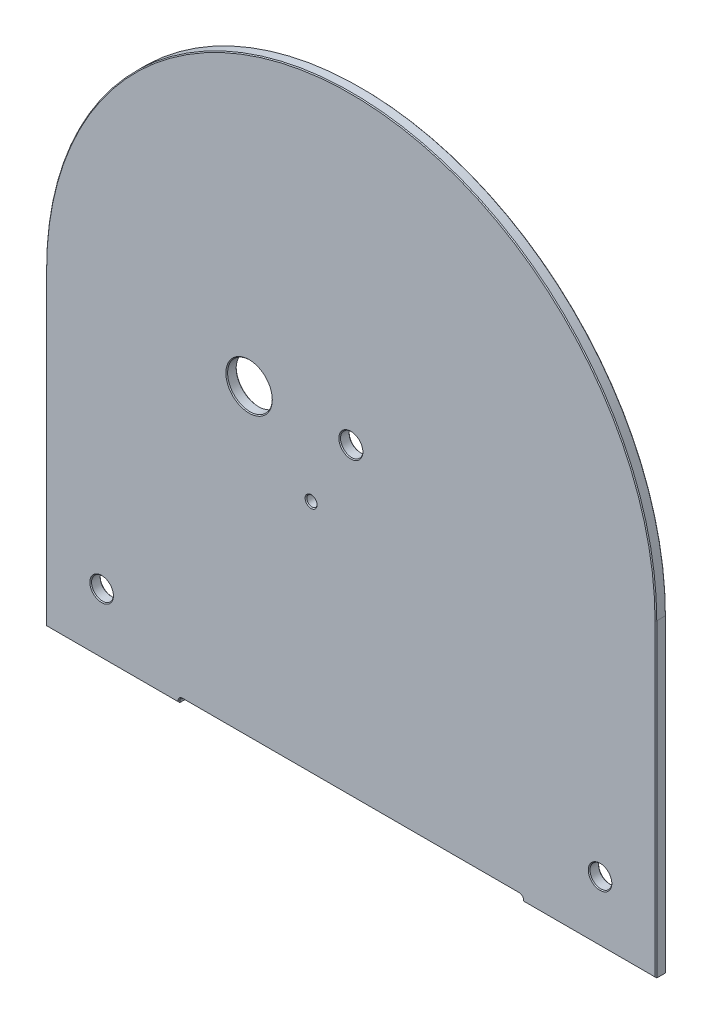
from build123d import *

# Parameters (mm, degrees)
SKETCH_1_R      = 6.35
SKETCH_1_R_2    = 6.5
SKETCH_1_R_3    = 13
SKETCH_1_R_4    = 3
EXTRUDE_1_DEPTH = 6
CHAMFER_1_SIZE  = 0.5


with BuildPart() as part:
    # Sketch 1 → Extrude 1 (new body)
    with BuildSketch(Plane.XY):
        with BuildLine():
            Line((177.5, 1.27), (177.5, -178.73))
            Line((177.5, -178.73), (100, -178.73))
            Line((100, -178.73), (100, -177.73))
            ThreePointArc((100, -177.73), (99.414213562, -176.315786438), (98, -175.73))
            Line((98, -175.73), (-98, -175.73))
            ThreePointArc((-98, -175.73), (-99.414213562, -176.315786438), (-100, -177.73))
            Line((-100, -177.73), (-100, -178.73))
            Line((-100, -178.73), (-177.5, -178.73))
            Line((-177.5, -178.73), (-177.5, 1.27))
            ThreePointArc((-177.5, 1.27), (0, 178.77), (177.5, 1.27))
        make_face()
        with Locations((-145, -143.73)):
            Circle(SKETCH_1_R, mode=Mode.SUBTRACT)
        with Locations((145, -143.73)):
            Circle(SKETCH_1_R, mode=Mode.SUBTRACT)
        with Locations((0, 1.27)):
            Circle(SKETCH_1_R_2, mode=Mode.SUBTRACT)
        with Locations((-59.2, 1.27)):
            Circle(SKETCH_1_R_3, mode=Mode.SUBTRACT)
        with Locations((-23.12, -38.728819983)):
            Circle(SKETCH_1_R_4, mode=Mode.SUBTRACT)
    extrude(amount=EXTRUDE_1_DEPTH)

    # Chamfer 1
    chamfer_1_edges = [part.edges().sort_by_distance(p)[0] for p in [
        (99.414213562, -176.315786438, 6),
        (-177.5, -88.73, 0),
        (0, 178.77, 0),
        (177.5, -88.73, 0),
        (138.75, -178.73, 0),
        (100, -178.23, 0),
        (99.414213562, -176.315786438, 0),
        (0, -175.73, 0),
        (-99.414213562, -176.315786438, 0),
        (100, -178.23, 6),
        (138.75, -178.73, 6),
        (177.5, -88.73, 6),
        (0, 178.77, 6),
        (-177.5, -88.73, 6),
        (-151.35, -143.73, 0),
        (-151.35, -143.73, 6),
        (-138.75, -178.73, 6),
        (138.65, -143.73, 0),
        (138.65, -143.73, 6),
        (-100, -178.23, 6),
        (-6.5, 1.27, 0),
        (-6.5, 1.27, 6),
        (-26.12, -38.728819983, 0),
        (-26.12, -38.728819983, 6),
        (-99.414213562, -176.315786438, 6),
        (-72.2, 1.27, 0),
        (-72.2, 1.27, 6),
        (0, -175.73, 6),
        (-100, -178.23, 0),
        (-138.75, -178.73, 0),
    ]]
    chamfer(chamfer_1_edges, length=CHAMFER_1_SIZE)


solid = part.part
